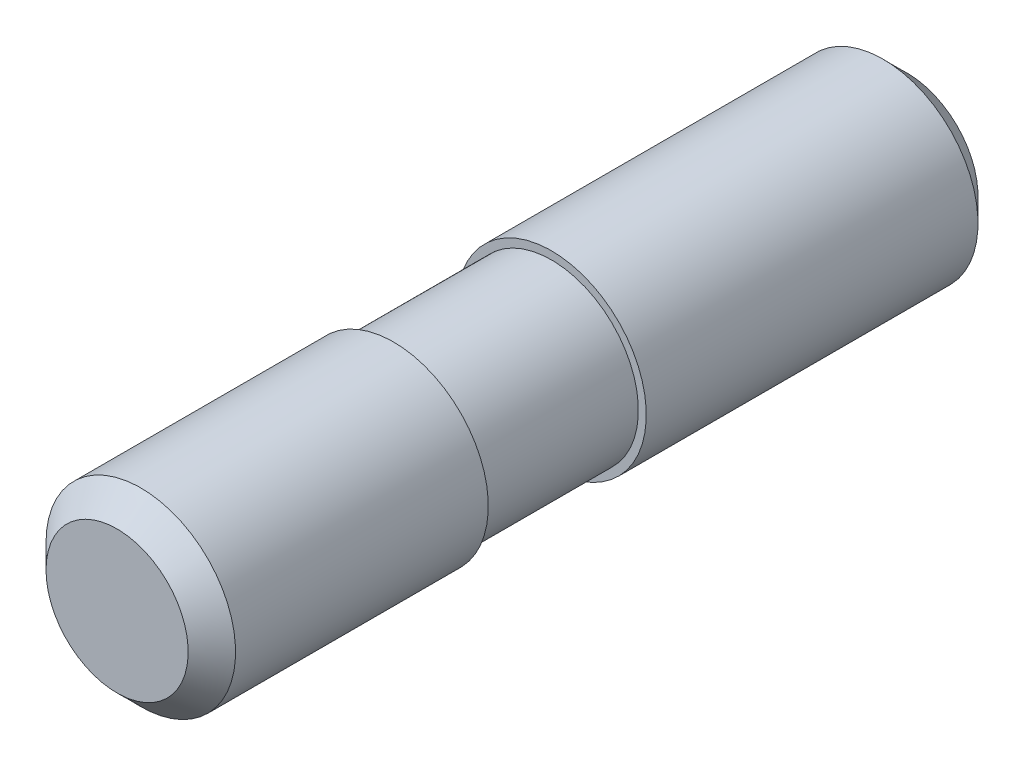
ISO-10303-21;
HEADER;
FILE_DESCRIPTION(('STEP AP214'),'2;1');
FILE_NAME('part.step','',(''),(''),'','','');
FILE_SCHEMA(('AUTOMOTIVE_DESIGN { 1 0 10303 214 1 1 1 1 }'));
ENDSEC;
DATA;
#1=APPLICATION_CONTEXT('core data for automotive mechanical design processes');
#2=APPLICATION_PROTOCOL_DEFINITION('international standard','automotive_design',2000,#1);
#3=PRODUCT_CONTEXT('',#1,'mechanical');
#4=PRODUCT('Part','Part','',(#3));
#5=PRODUCT_RELATED_PRODUCT_CATEGORY('part','',(#4));
#6=PRODUCT_DEFINITION_FORMATION('','',#4);
#7=PRODUCT_DEFINITION_CONTEXT('part definition',#1,'design');
#8=PRODUCT_DEFINITION('design','',#6,#7);
#9=PRODUCT_DEFINITION_SHAPE('','',#8);
#10=(LENGTH_UNIT() NAMED_UNIT(*) SI_UNIT(.MILLI.,.METRE.));
#11=(NAMED_UNIT(*) PLANE_ANGLE_UNIT() SI_UNIT($,.RADIAN.));
#12=(NAMED_UNIT(*) SI_UNIT($,.STERADIAN.) SOLID_ANGLE_UNIT());
#13=UNCERTAINTY_MEASURE_WITH_UNIT(LENGTH_MEASURE(1.E-05),#10,'distance_accuracy_value','');
#14=(GEOMETRIC_REPRESENTATION_CONTEXT(3) GLOBAL_UNCERTAINTY_ASSIGNED_CONTEXT((#13)) GLOBAL_UNIT_ASSIGNED_CONTEXT((#10,
#11,#12)) REPRESENTATION_CONTEXT('',''));
#15=CARTESIAN_POINT('',(0.,0.,0.));
#16=DIRECTION('',(0.,0.,1.));
#17=DIRECTION('',(1.,0.,0.));
#18=AXIS2_PLACEMENT_3D('',#15,#16,#17);
#19=CARTESIAN_POINT('',(-9.,0.,0.));
#20=DIRECTION('',(0.,0.,-1.));
#21=DIRECTION('',(-1.,0.,0.));
#22=AXIS2_PLACEMENT_3D('',#19,#20,#21);
#23=PLANE('',#22);
#24=CARTESIAN_POINT('',(0.,0.,0.));
#25=DIRECTION('',(0.,0.,-1.));
#26=DIRECTION('',(-1.,0.,0.));
#27=AXIS2_PLACEMENT_3D('',#24,#25,#26);
#28=CIRCLE('',#27,9.);
#29=CARTESIAN_POINT('',(-9.,0.,0.));
#30=VERTEX_POINT('',#29);
#31=EDGE_CURVE('E40',#30,#30,#28,.T.);
#32=ORIENTED_EDGE('',*,*,#31,.T.);
#33=EDGE_LOOP('',(#32));
#34=FACE_BOUND('',#33,.T.);
#35=ADVANCED_FACE('F12',(#34),#23,.T.);
#36=CARTESIAN_POINT('',(0.,0.,100.));
#37=DIRECTION('',(0.,0.,1.));
#38=DIRECTION('',(1.,0.,0.));
#39=AXIS2_PLACEMENT_3D('',#36,#37,#38);
#40=PLANE('',#39);
#41=CARTESIAN_POINT('',(0.,0.,100.));
#42=DIRECTION('',(0.,0.,-1.));
#43=DIRECTION('',(-1.,0.,0.));
#44=AXIS2_PLACEMENT_3D('',#41,#42,#43);
#45=CIRCLE('',#44,9.);
#46=CARTESIAN_POINT('',(-9.,0.,100.));
#47=VERTEX_POINT('',#46);
#48=EDGE_CURVE('E8',#47,#47,#45,.T.);
#49=ORIENTED_EDGE('',*,*,#48,.F.);
#50=EDGE_LOOP('',(#49));
#51=FACE_BOUND('',#50,.T.);
#52=ADVANCED_FACE('F58',(#51),#40,.T.);
#53=CARTESIAN_POINT('',(0.,0.,97.));
#54=DIRECTION('',(0.,0.,-1.));
#55=DIRECTION('',(-1.,0.,0.));
#56=AXIS2_PLACEMENT_3D('',#53,#54,#55);
#57=CONICAL_SURFACE('',#56,12.,0.785398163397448);
#58=ORIENTED_EDGE('',*,*,#48,.T.);
#59=EDGE_LOOP('',(#58));
#60=FACE_BOUND('',#59,.T.);
#61=CARTESIAN_POINT('',(0.,0.,97.));
#62=DIRECTION('',(0.,0.,-1.));
#63=DIRECTION('',(-1.,0.,0.));
#64=AXIS2_PLACEMENT_3D('',#61,#62,#63);
#65=CIRCLE('',#64,12.);
#66=CARTESIAN_POINT('',(-12.,0.,97.));
#67=VERTEX_POINT('',#66);
#68=EDGE_CURVE('E18',#67,#67,#65,.T.);
#69=ORIENTED_EDGE('',*,*,#68,.F.);
#70=EDGE_LOOP('',(#69));
#71=FACE_BOUND('',#70,.T.);
#72=ADVANCED_FACE('F62',(#60,#71),#57,.T.);
#73=CARTESIAN_POINT('',(0.,0.,0.));
#74=DIRECTION('',(0.,0.,-1.));
#75=DIRECTION('',(-1.,0.,0.));
#76=AXIS2_PLACEMENT_3D('',#73,#74,#75);
#77=CYLINDRICAL_SURFACE('',#76,12.);
#78=ORIENTED_EDGE('',*,*,#68,.T.);
#79=EDGE_LOOP('',(#78));
#80=FACE_BOUND('',#79,.T.);
#81=CARTESIAN_POINT('',(0.,0.,65.));
#82=DIRECTION('',(0.,0.,-1.));
#83=DIRECTION('',(-1.,0.,0.));
#84=AXIS2_PLACEMENT_3D('',#81,#82,#83);
#85=CIRCLE('',#84,12.);
#86=CARTESIAN_POINT('',(-12.,0.,65.));
#87=VERTEX_POINT('',#86);
#88=EDGE_CURVE('E22',#87,#87,#85,.T.);
#89=ORIENTED_EDGE('',*,*,#88,.F.);
#90=EDGE_LOOP('',(#89));
#91=FACE_BOUND('',#90,.T.);
#92=ADVANCED_FACE('F67',(#80,#91),#77,.T.);
#93=CARTESIAN_POINT('',(-12.,0.,65.));
#94=DIRECTION('',(0.,0.,-1.));
#95=DIRECTION('',(-1.,0.,0.));
#96=AXIS2_PLACEMENT_3D('',#93,#94,#95);
#97=PLANE('',#96);
#98=ORIENTED_EDGE('',*,*,#88,.T.);
#99=EDGE_LOOP('',(#98));
#100=FACE_BOUND('',#99,.T.);
#101=CARTESIAN_POINT('',(0.,0.,65.));
#102=DIRECTION('',(0.,0.,-1.));
#103=DIRECTION('',(-1.,0.,0.));
#104=AXIS2_PLACEMENT_3D('',#101,#102,#103);
#105=CIRCLE('',#104,11.);
#106=CARTESIAN_POINT('',(-11.,0.,65.));
#107=VERTEX_POINT('',#106);
#108=EDGE_CURVE('E26',#107,#107,#105,.T.);
#109=ORIENTED_EDGE('',*,*,#108,.F.);
#110=EDGE_LOOP('',(#109));
#111=FACE_BOUND('',#110,.T.);
#112=ADVANCED_FACE('F72',(#100,#111),#97,.T.);
#113=CARTESIAN_POINT('',(0.,0.,0.));
#114=DIRECTION('',(0.,0.,-1.));
#115=DIRECTION('',(-1.,0.,0.));
#116=AXIS2_PLACEMENT_3D('',#113,#114,#115);
#117=CYLINDRICAL_SURFACE('',#116,11.);
#118=ORIENTED_EDGE('',*,*,#108,.T.);
#119=EDGE_LOOP('',(#118));
#120=FACE_BOUND('',#119,.T.);
#121=CARTESIAN_POINT('',(0.,0.,45.));
#122=DIRECTION('',(0.,0.,-1.));
#123=DIRECTION('',(-1.,0.,0.));
#124=AXIS2_PLACEMENT_3D('',#121,#122,#123);
#125=CIRCLE('',#124,11.);
#126=CARTESIAN_POINT('',(-11.,0.,45.));
#127=VERTEX_POINT('',#126);
#128=EDGE_CURVE('E31',#127,#127,#125,.T.);
#129=ORIENTED_EDGE('',*,*,#128,.F.);
#130=EDGE_LOOP('',(#129));
#131=FACE_BOUND('',#130,.T.);
#132=ADVANCED_FACE('F75',(#120,#131),#117,.T.);
#133=CARTESIAN_POINT('',(-11.,0.,45.));
#134=DIRECTION('',(0.,0.,1.));
#135=DIRECTION('',(1.,0.,0.));
#136=AXIS2_PLACEMENT_3D('',#133,#134,#135);
#137=PLANE('',#136);
#138=ORIENTED_EDGE('',*,*,#128,.T.);
#139=EDGE_LOOP('',(#138));
#140=FACE_BOUND('',#139,.T.);
#141=CARTESIAN_POINT('',(0.,0.,45.));
#142=DIRECTION('',(0.,0.,-1.));
#143=DIRECTION('',(-1.,0.,0.));
#144=AXIS2_PLACEMENT_3D('',#141,#142,#143);
#145=CIRCLE('',#144,12.);
#146=CARTESIAN_POINT('',(-12.,0.,45.));
#147=VERTEX_POINT('',#146);
#148=EDGE_CURVE('E34',#147,#147,#145,.T.);
#149=ORIENTED_EDGE('',*,*,#148,.F.);
#150=EDGE_LOOP('',(#149));
#151=FACE_BOUND('',#150,.T.);
#152=ADVANCED_FACE('F54',(#140,#151),#137,.T.);
#153=CARTESIAN_POINT('',(0.,0.,0.));
#154=DIRECTION('',(0.,0.,-1.));
#155=DIRECTION('',(-1.,0.,0.));
#156=AXIS2_PLACEMENT_3D('',#153,#154,#155);
#157=CYLINDRICAL_SURFACE('',#156,12.);
#158=ORIENTED_EDGE('',*,*,#148,.T.);
#159=EDGE_LOOP('',(#158));
#160=FACE_BOUND('',#159,.T.);
#161=CARTESIAN_POINT('',(0.,0.,3.));
#162=DIRECTION('',(0.,0.,-1.));
#163=DIRECTION('',(-1.,0.,0.));
#164=AXIS2_PLACEMENT_3D('',#161,#162,#163);
#165=CIRCLE('',#164,12.);
#166=CARTESIAN_POINT('',(-12.,0.,3.));
#167=VERTEX_POINT('',#166);
#168=EDGE_CURVE('E37',#167,#167,#165,.T.);
#169=ORIENTED_EDGE('',*,*,#168,.F.);
#170=EDGE_LOOP('',(#169));
#171=FACE_BOUND('',#170,.T.);
#172=ADVANCED_FACE('F47',(#160,#171),#157,.T.);
#173=CARTESIAN_POINT('',(0.,0.,0.));
#174=DIRECTION('',(0.,0.,1.));
#175=DIRECTION('',(1.,0.,0.));
#176=AXIS2_PLACEMENT_3D('',#173,#174,#175);
#177=CONICAL_SURFACE('',#176,9.,0.785398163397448);
#178=ORIENTED_EDGE('',*,*,#168,.T.);
#179=EDGE_LOOP('',(#178));
#180=FACE_BOUND('',#179,.T.);
#181=ORIENTED_EDGE('',*,*,#31,.F.);
#182=EDGE_LOOP('',(#181));
#183=FACE_BOUND('',#182,.T.);
#184=ADVANCED_FACE('F45',(#180,#183),#177,.T.);
#185=CLOSED_SHELL('',(#35,#52,#72,#92,#112,#132,#152,#172,#184));
#186=MANIFOLD_SOLID_BREP('B1',#185);
#187=ADVANCED_BREP_SHAPE_REPRESENTATION('',(#18,#186),#14);
#188=SHAPE_DEFINITION_REPRESENTATION(#9,#187);
ENDSEC;
END-ISO-10303-21;
